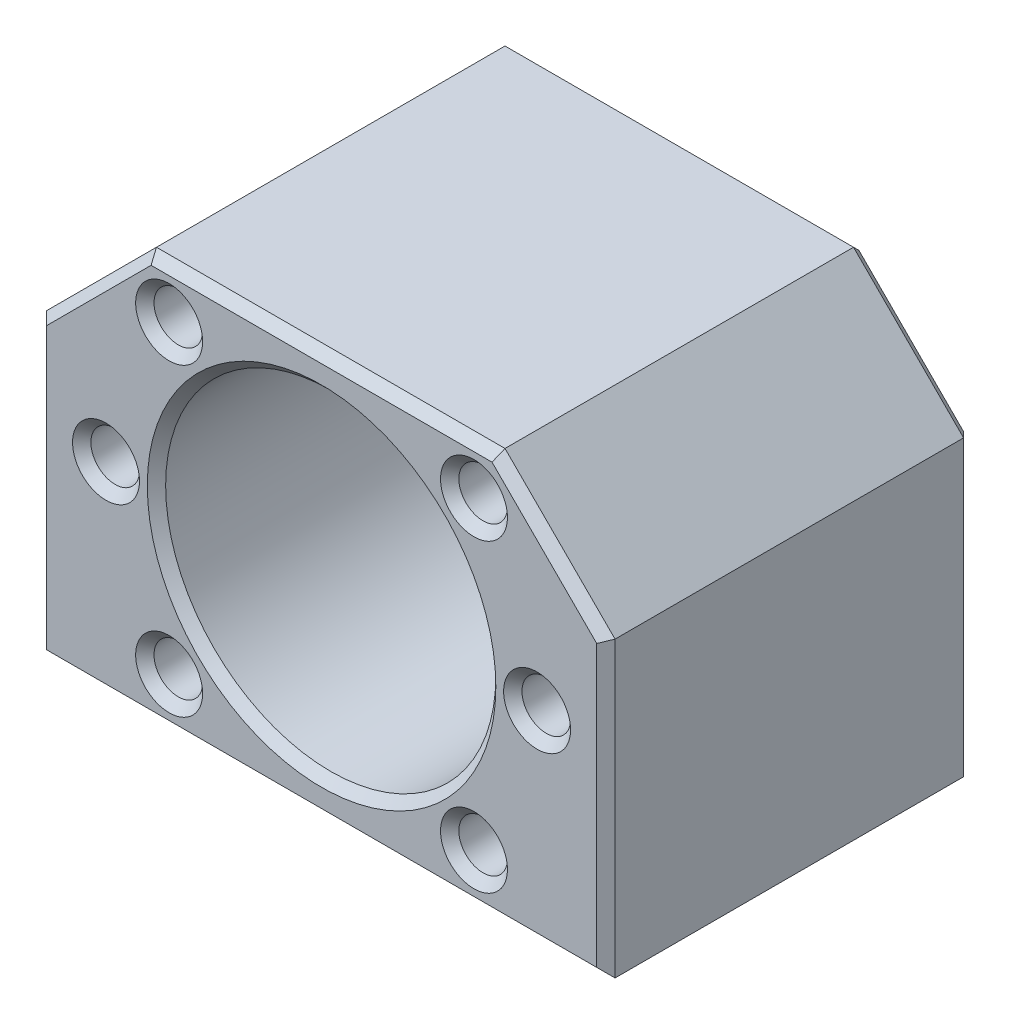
from build123d import *

# Parameters (mm, degrees)
SKETCH_2_R          = 18
EXTRUDE_1_DEPTH     = 20
CUT_EXTRUDE_START   = 20
SKETCH_2_3_R        = 2.65
CUT_EXTRUDE_1_DEPTH = 15
SKETCH_3_R          = 2.65
CUT_EXTRUDE_2_DEPTH = 15
CHAMFER_1_SIZE      = 1


with BuildPart() as part:
    # Sketch 2 → Extrude 1 (new, symmetric)
    with BuildSketch(Plane.XY):
        Polygon((-31, 10), (-19, 22), (19, 22), (31, 10), (31, -22), (-31, -22), align=None)
        Circle(SKETCH_2_R, mode=Mode.SUBTRACT)
    extrude(amount=EXTRUDE_1_DEPTH, both=True)

    # Sketch 2_3 → Cut-Extrude 1 (cut)
    with BuildSketch(Plane.XY.offset(CUT_EXTRUDE_START)):
        with Locations((-23.5, 0)):
            Circle(SKETCH_2_3_R)
        with Locations((-16.617009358, 16.617009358)):
            Circle(SKETCH_2_3_R)
        with Locations((16.617009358, 16.617009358)):
            Circle(SKETCH_2_3_R)
        with Locations((23.5, 0)):
            Circle(SKETCH_2_3_R)
        with Locations((16.617009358, -16.617009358)):
            Circle(SKETCH_2_3_R)
        with Locations((-16.617009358, -16.617009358)):
            Circle(SKETCH_2_3_R)
    extrude(amount=-CUT_EXTRUDE_1_DEPTH, mode=Mode.SUBTRACT)

    # Sketch 3 → Cut-Extrude 2 (cut)
    with BuildSketch(Plane.XZ.offset(22)):
        with Locations(Location((-24, 12, 0), (0, 0, 270))):
            Circle(SKETCH_3_R)
        with Locations(Location((24, 12, 0), (0, 0, 90))):
            Circle(SKETCH_3_R)
        with Locations(Location((24, -12, 0), (0, 0, 270))):
            Circle(SKETCH_3_R)
        with Locations(Location((-24, -12, 0), (0, 0, 90))):
            Circle(SKETCH_3_R)
    extrude(amount=-CUT_EXTRUDE_2_DEPTH, mode=Mode.SUBTRACT)

    # Chamfer 1
    chamfer_1_edges = [part.edges().sort_by_distance(p)[0] for p in [
        (25, 16, 20),
        (0, 22, 20),
        (-18, 0, -20),
        (-18, 0, 20),
        (-25, 16, 20),
        (-31, -6, 20),
        (-26.15, 0, 20),
        (-19.267009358, -16.617009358, 20),
        (13.967009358, -16.617009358, 20),
        (20.85, 0, 20),
        (13.967009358, 16.617009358, 20),
        (-19.267009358, 16.617009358, 20),
        (-24, -22, -14.65),
        (0, -22, 20),
        (24, -22, -9.35),
        (24, -22, 9.35),
        (-24, -22, 14.65),
        (-31, -6, -20),
        (-25, 16, -20),
        (0, 22, -20),
        (25, 16, -20),
        (31, -6, -20),
        (0, -22, -20),
        (31, -6, 20),
    ]]
    chamfer(chamfer_1_edges, length=CHAMFER_1_SIZE)


solid = part.part
